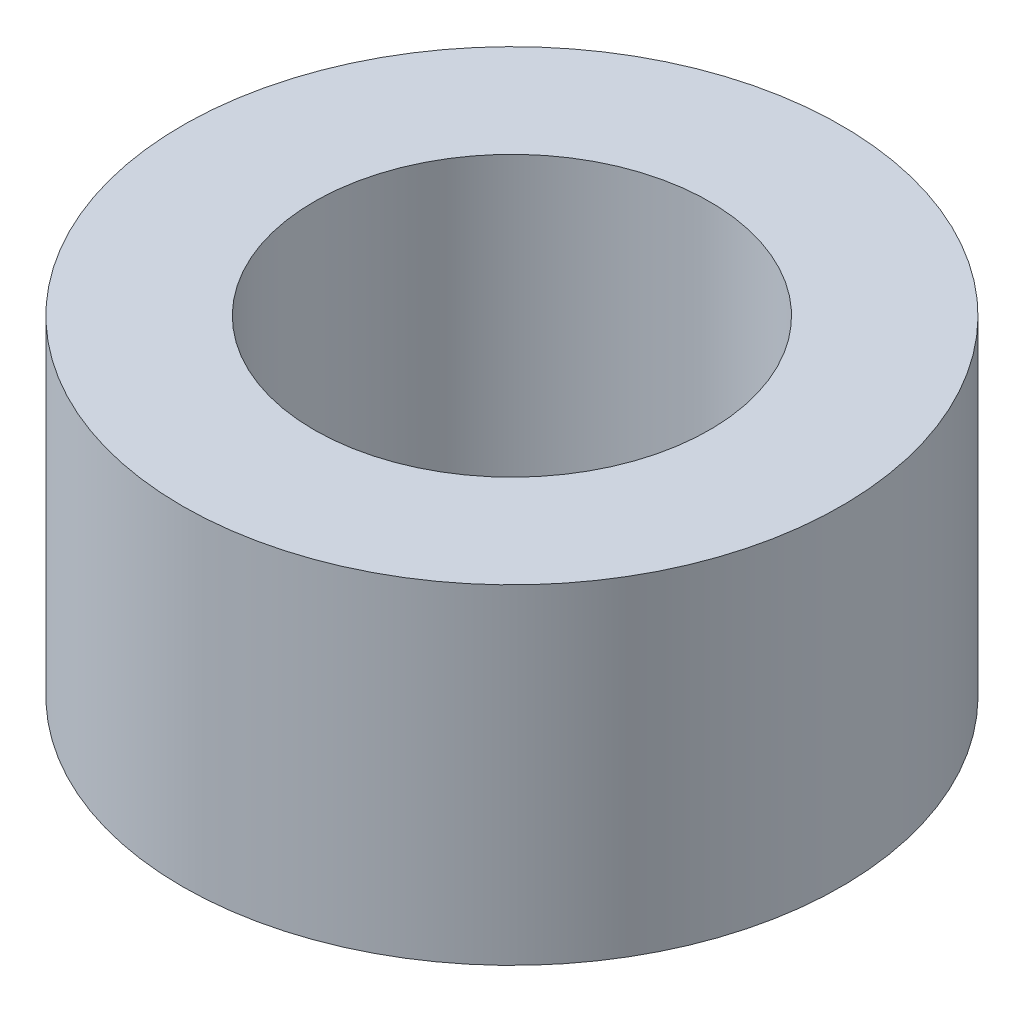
ISO-10303-21;
HEADER;
FILE_DESCRIPTION(('STEP AP214'),'2;1');
FILE_NAME('part.step','',(''),(''),'','','');
FILE_SCHEMA(('AUTOMOTIVE_DESIGN { 1 0 10303 214 1 1 1 1 }'));
ENDSEC;
DATA;
#1=APPLICATION_CONTEXT('core data for automotive mechanical design processes');
#2=APPLICATION_PROTOCOL_DEFINITION('international standard','automotive_design',2000,#1);
#3=PRODUCT_CONTEXT('',#1,'mechanical');
#4=PRODUCT('Part','Part','',(#3));
#5=PRODUCT_RELATED_PRODUCT_CATEGORY('part','',(#4));
#6=PRODUCT_DEFINITION_FORMATION('','',#4);
#7=PRODUCT_DEFINITION_CONTEXT('part definition',#1,'design');
#8=PRODUCT_DEFINITION('design','',#6,#7);
#9=PRODUCT_DEFINITION_SHAPE('','',#8);
#10=(LENGTH_UNIT() NAMED_UNIT(*) SI_UNIT(.MILLI.,.METRE.));
#11=(NAMED_UNIT(*) PLANE_ANGLE_UNIT() SI_UNIT($,.RADIAN.));
#12=(NAMED_UNIT(*) SI_UNIT($,.STERADIAN.) SOLID_ANGLE_UNIT());
#13=UNCERTAINTY_MEASURE_WITH_UNIT(LENGTH_MEASURE(1.E-05),#10,'distance_accuracy_value','');
#14=(GEOMETRIC_REPRESENTATION_CONTEXT(3) GLOBAL_UNCERTAINTY_ASSIGNED_CONTEXT((#13)) GLOBAL_UNIT_ASSIGNED_CONTEXT((#10,
#11,#12)) REPRESENTATION_CONTEXT('',''));
#15=CARTESIAN_POINT('',(0.,0.,0.));
#16=DIRECTION('',(0.,0.,1.));
#17=DIRECTION('',(1.,0.,0.));
#18=AXIS2_PLACEMENT_3D('',#15,#16,#17);
#19=CARTESIAN_POINT('',(0.,6.35,0.));
#20=DIRECTION('',(0.,1.,0.));
#21=DIRECTION('',(0.,0.,1.));
#22=AXIS2_PLACEMENT_3D('',#19,#20,#21);
#23=PLANE('',#22);
#24=CARTESIAN_POINT('',(0.,6.35,0.));
#25=DIRECTION('',(0.,1.,0.));
#26=DIRECTION('',(0.,0.,1.));
#27=AXIS2_PLACEMENT_3D('',#24,#25,#26);
#28=CIRCLE('',#27,6.35);
#29=CARTESIAN_POINT('',(0.,6.35,6.35));
#30=VERTEX_POINT('',#29);
#31=EDGE_CURVE('E10',#30,#30,#28,.T.);
#32=ORIENTED_EDGE('',*,*,#31,.T.);
#33=EDGE_LOOP('',(#32));
#34=FACE_BOUND('',#33,.T.);
#35=CARTESIAN_POINT('',(0.,6.35,0.));
#36=DIRECTION('',(0.,1.,0.));
#37=DIRECTION('',(0.,0.,1.));
#38=AXIS2_PLACEMENT_3D('',#35,#36,#37);
#39=CIRCLE('',#38,3.81);
#40=CARTESIAN_POINT('',(0.,6.35,3.81));
#41=VERTEX_POINT('',#40);
#42=EDGE_CURVE('E41',#41,#41,#39,.T.);
#43=ORIENTED_EDGE('',*,*,#42,.F.);
#44=EDGE_LOOP('',(#43));
#45=FACE_BOUND('',#44,.T.);
#46=ADVANCED_FACE('F30',(#34,#45),#23,.T.);
#47=CARTESIAN_POINT('',(0.,0.,0.));
#48=DIRECTION('',(0.,1.,0.));
#49=DIRECTION('',(0.,0.,1.));
#50=AXIS2_PLACEMENT_3D('',#47,#48,#49);
#51=PLANE('',#50);
#52=CARTESIAN_POINT('',(0.,0.,0.));
#53=DIRECTION('',(0.,1.,0.));
#54=DIRECTION('',(0.,0.,1.));
#55=AXIS2_PLACEMENT_3D('',#52,#53,#54);
#56=CIRCLE('',#55,6.35);
#57=CARTESIAN_POINT('',(0.,0.,6.35));
#58=VERTEX_POINT('',#57);
#59=EDGE_CURVE('E34',#58,#58,#56,.T.);
#60=ORIENTED_EDGE('',*,*,#59,.F.);
#61=EDGE_LOOP('',(#60));
#62=FACE_BOUND('',#61,.T.);
#63=CARTESIAN_POINT('',(0.,0.,0.));
#64=DIRECTION('',(0.,1.,0.));
#65=DIRECTION('',(0.,0.,1.));
#66=AXIS2_PLACEMENT_3D('',#63,#64,#65);
#67=CIRCLE('',#66,3.81);
#68=CARTESIAN_POINT('',(0.,0.,3.81));
#69=VERTEX_POINT('',#68);
#70=EDGE_CURVE('E43',#69,#69,#67,.T.);
#71=ORIENTED_EDGE('',*,*,#70,.T.);
#72=EDGE_LOOP('',(#71));
#73=FACE_BOUND('',#72,.T.);
#74=ADVANCED_FACE('F53',(#62,#73),#51,.F.);
#75=CARTESIAN_POINT('',(0.,6.35,0.));
#76=DIRECTION('',(0.,-1.,0.));
#77=DIRECTION('',(0.,0.,-1.));
#78=AXIS2_PLACEMENT_3D('',#75,#76,#77);
#79=CYLINDRICAL_SURFACE('',#78,6.35);
#80=ORIENTED_EDGE('',*,*,#31,.F.);
#81=EDGE_LOOP('',(#80));
#82=FACE_BOUND('',#81,.T.);
#83=ORIENTED_EDGE('',*,*,#59,.T.);
#84=EDGE_LOOP('',(#83));
#85=FACE_BOUND('',#84,.T.);
#86=ADVANCED_FACE('F32',(#82,#85),#79,.T.);
#87=CARTESIAN_POINT('',(0.,6.35,0.));
#88=DIRECTION('',(0.,-1.,0.));
#89=DIRECTION('',(0.,0.,-1.));
#90=AXIS2_PLACEMENT_3D('',#87,#88,#89);
#91=CYLINDRICAL_SURFACE('',#90,3.81);
#92=ORIENTED_EDGE('',*,*,#42,.T.);
#93=EDGE_LOOP('',(#92));
#94=FACE_BOUND('',#93,.T.);
#95=ORIENTED_EDGE('',*,*,#70,.F.);
#96=EDGE_LOOP('',(#95));
#97=FACE_BOUND('',#96,.T.);
#98=ADVANCED_FACE('F49',(#94,#97),#91,.F.);
#99=CLOSED_SHELL('',(#46,#74,#86,#98));
#100=MANIFOLD_SOLID_BREP('B2',#99);
#101=ADVANCED_BREP_SHAPE_REPRESENTATION('',(#18,#100),#14);
#102=SHAPE_DEFINITION_REPRESENTATION(#9,#101);
ENDSEC;
END-ISO-10303-21;
